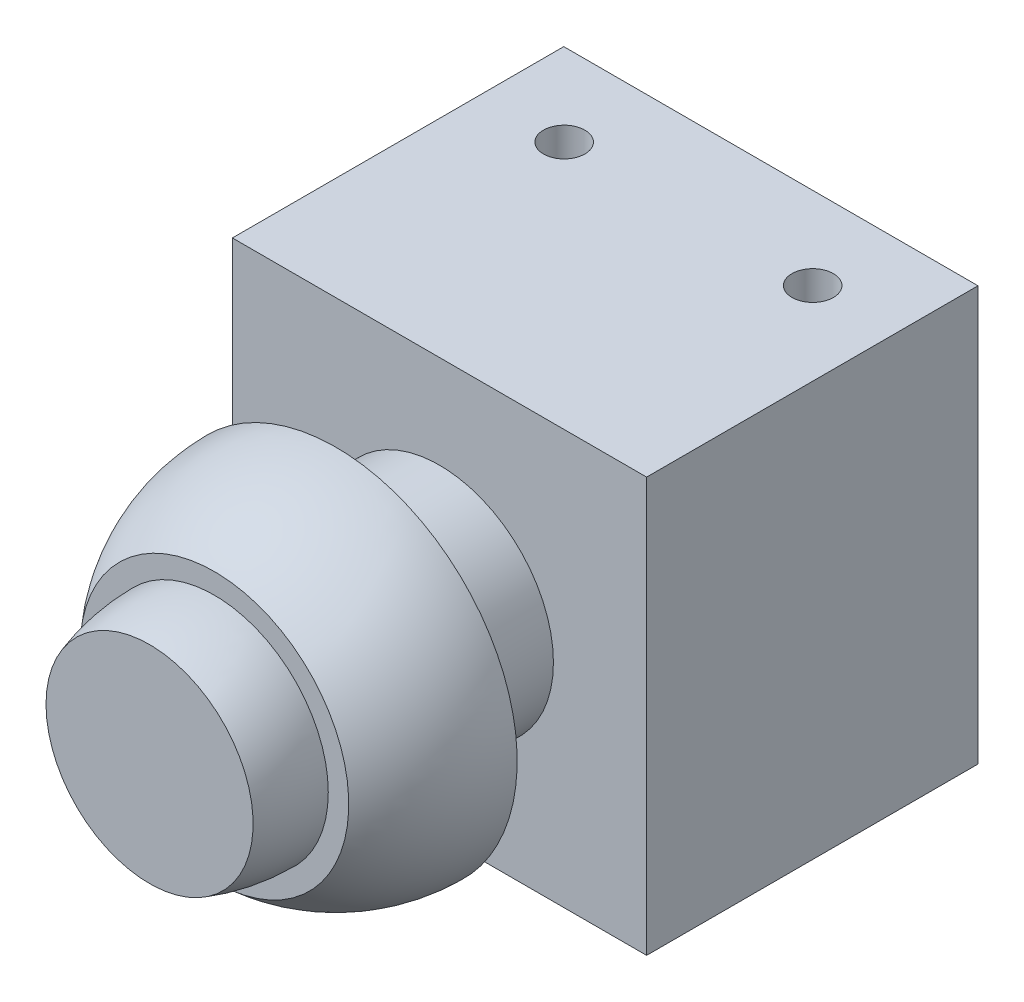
from build123d import *

# Parameters (mm, degrees)
ESQUISSE1_W      = 40
ESQUISSE1_H      = 40
EXTRUSION1_DEPTH = 32
ESQUISSE2_R      = 2
EXTRUSION2_DEPTH = 5


with BuildPart() as part:
    # EW_SKETCH → R_volution1 (revolve)
    with BuildSketch(Plane(origin=(0, 0, 0), x_dir=(0, 0, -1), z_dir=(1, 0, 0)), mode=Mode.PRIVATE) as r_volution1_sk:
        with BuildLine():
            Line((42, 11), (0, 11))
            Line((0, 11), (0, 17.5))
            ThreePointArc((0, 17.5), (-6.29110994, 16.330092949), (-11.741075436, 12.976792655))
            Line((-11.741075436, 12.976792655), (-11.741075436, 11))
            ThreePointArc((-11.741075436, 11), (-14.910228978, 10.748424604), (-18, 10))
            Line((-18, 10), (-18, 0))
            Line((-18, 0), (0, 0))
            Line((0, 0), (42, 0))
            Line((42, 0), (42, 11))
        make_face()
    revolve(r_volution1_sk.sketch.rotate(Axis((0, 0, 0), (0, 0, 1)), 90), axis=Axis((0, 0, 0), (0, 0, 1)))

    # Esquisse1 → Extrusion1 (add)
    with BuildSketch(Plane(origin=(0, 0, -42), x_dir=(-1, 0, 0), z_dir=(0, 0, -1))):
        Rectangle(ESQUISSE1_W, ESQUISSE1_H)
    extrude(amount=-EXTRUSION1_DEPTH)

    # Esquisse2 → Extrusion2 (cut)
    with BuildSketch(Plane(origin=(0, 20, 0), x_dir=(1, 0, 0), z_dir=(0, 1, 0))):
        with Locations(Location((-12, 34.03671104, 0), (0, 0, 270))):
            Circle(ESQUISSE2_R)
        with Locations(Location((12, 34.03671104, 0), (0, 0, 270))):
            Circle(ESQUISSE2_R)
    extrusion2 = extrude(amount=-EXTRUSION2_DEPTH, mode=Mode.SUBTRACT)

    # Sym_trie1: Extrusion2 across plane
    add(extrusion2.mirror(Plane.ZX), mode=Mode.SUBTRACT)


solid = part.part
